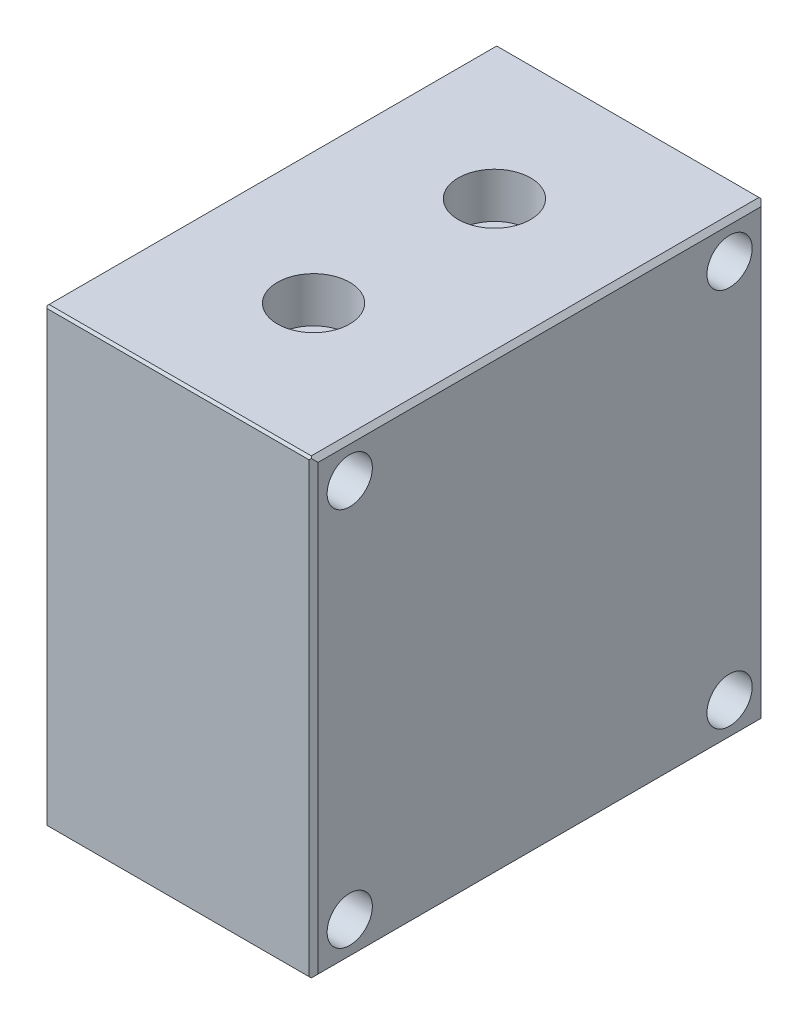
ISO-10303-21;
HEADER;
FILE_DESCRIPTION(('STEP AP214'),'2;1');
FILE_NAME('part.step','',(''),(''),'','','');
FILE_SCHEMA(('AUTOMOTIVE_DESIGN { 1 0 10303 214 1 1 1 1 }'));
ENDSEC;
DATA;
#1=APPLICATION_CONTEXT('core data for automotive mechanical design processes');
#2=APPLICATION_PROTOCOL_DEFINITION('international standard','automotive_design',2000,#1);
#3=PRODUCT_CONTEXT('',#1,'mechanical');
#4=PRODUCT('Part','Part','',(#3));
#5=PRODUCT_RELATED_PRODUCT_CATEGORY('part','',(#4));
#6=PRODUCT_DEFINITION_FORMATION('','',#4);
#7=PRODUCT_DEFINITION_CONTEXT('part definition',#1,'design');
#8=PRODUCT_DEFINITION('design','',#6,#7);
#9=PRODUCT_DEFINITION_SHAPE('','',#8);
#10=(LENGTH_UNIT() NAMED_UNIT(*) SI_UNIT(.MILLI.,.METRE.));
#11=(NAMED_UNIT(*) PLANE_ANGLE_UNIT() SI_UNIT($,.RADIAN.));
#12=(NAMED_UNIT(*) SI_UNIT($,.STERADIAN.) SOLID_ANGLE_UNIT());
#13=UNCERTAINTY_MEASURE_WITH_UNIT(LENGTH_MEASURE(1.E-05),#10,'distance_accuracy_value','');
#14=(GEOMETRIC_REPRESENTATION_CONTEXT(3) GLOBAL_UNCERTAINTY_ASSIGNED_CONTEXT((#13)) GLOBAL_UNIT_ASSIGNED_CONTEXT((#10,
#11,#12)) REPRESENTATION_CONTEXT('',''));
#15=CARTESIAN_POINT('',(0.,0.,0.));
#16=DIRECTION('',(0.,0.,1.));
#17=DIRECTION('',(1.,0.,0.));
#18=AXIS2_PLACEMENT_3D('',#15,#16,#17);
#19=CARTESIAN_POINT('',(0.,20.,0.));
#20=DIRECTION('',(0.,1.,0.));
#21=DIRECTION('',(0.,0.,1.));
#22=AXIS2_PLACEMENT_3D('',#19,#20,#21);
#23=PLANE('',#22);
#24=CARTESIAN_POINT('',(15.,20.,10.));
#25=DIRECTION('',(0.,1.,0.));
#26=DIRECTION('',(0.,0.,1.));
#27=AXIS2_PLACEMENT_3D('',#24,#25,#26);
#28=CIRCLE('',#27,4.);
#29=CARTESIAN_POINT('',(15.,20.,14.));
#30=VERTEX_POINT('',#29);
#31=EDGE_CURVE('E19',#30,#30,#28,.T.);
#32=ORIENTED_EDGE('',*,*,#31,.T.);
#33=EDGE_LOOP('',(#32));
#34=FACE_BOUND('',#33,.T.);
#35=ADVANCED_FACE('F16',(#34),#23,.T.);
#36=CARTESIAN_POINT('',(0.,20.,0.));
#37=DIRECTION('',(0.,1.,0.));
#38=DIRECTION('',(0.,0.,1.));
#39=AXIS2_PLACEMENT_3D('',#36,#37,#38);
#40=PLANE('',#39);
#41=CARTESIAN_POINT('',(15.,20.,-10.));
#42=DIRECTION('',(0.,1.,0.));
#43=DIRECTION('',(0.,0.,1.));
#44=AXIS2_PLACEMENT_3D('',#41,#42,#43);
#45=CIRCLE('',#44,4.);
#46=CARTESIAN_POINT('',(15.,20.,-6.));
#47=VERTEX_POINT('',#46);
#48=EDGE_CURVE('E160',#47,#47,#45,.T.);
#49=ORIENTED_EDGE('',*,*,#48,.T.);
#50=EDGE_LOOP('',(#49));
#51=FACE_BOUND('',#50,.T.);
#52=ADVANCED_FACE('F424',(#51),#40,.T.);
#53=CARTESIAN_POINT('',(15.,24.875,-24.875));
#54=DIRECTION('',(0.,0.707106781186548,-0.707106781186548));
#55=DIRECTION('',(0.,0.707106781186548,0.707106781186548));
#56=AXIS2_PLACEMENT_3D('',#53,#54,#55);
#57=PLANE('',#56);
#58=DIRECTION('',(-0.577350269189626,0.577350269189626,0.577350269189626));
#59=VECTOR('',#58,1.);
#60=CARTESIAN_POINT('',(29.625,24.875,-24.875));
#61=LINE('',#60,#59);
#62=CARTESIAN_POINT('',(29.625,24.875,-24.875));
#63=VERTEX_POINT('',#62);
#64=CARTESIAN_POINT('',(29.5,25.,-24.75));
#65=VERTEX_POINT('',#64);
#66=EDGE_CURVE('E211',#63,#65,#61,.T.);
#67=ORIENTED_EDGE('',*,*,#66,.F.);
#68=DIRECTION('',(0.577350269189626,0.577350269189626,0.577350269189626));
#69=VECTOR('',#68,1.);
#70=CARTESIAN_POINT('',(29.5,24.75,-25.));
#71=LINE('',#70,#69);
#72=CARTESIAN_POINT('',(29.5,24.75,-25.));
#73=VERTEX_POINT('',#72);
#74=EDGE_CURVE('E234',#73,#63,#71,.T.);
#75=ORIENTED_EDGE('',*,*,#74,.F.);
#76=DIRECTION('',(-1.,0.,0.));
#77=VECTOR('',#76,1.);
#78=CARTESIAN_POINT('',(0.,24.75,-25.));
#79=LINE('',#78,#77);
#80=CARTESIAN_POINT('',(0.5,24.75,-25.));
#81=VERTEX_POINT('',#80);
#82=EDGE_CURVE('E139',#81,#73,#79,.F.);
#83=ORIENTED_EDGE('',*,*,#82,.F.);
#84=DIRECTION('',(-0.577350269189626,0.577350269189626,0.577350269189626));
#85=VECTOR('',#84,1.);
#86=CARTESIAN_POINT('',(0.499999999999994,24.75,-25.));
#87=LINE('',#86,#85);
#88=CARTESIAN_POINT('',(0.375,24.875,-24.875));
#89=VERTEX_POINT('',#88);
#90=EDGE_CURVE('E131',#81,#89,#87,.T.);
#91=ORIENTED_EDGE('',*,*,#90,.T.);
#92=DIRECTION('',(0.577350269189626,0.577350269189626,0.577350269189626));
#93=VECTOR('',#92,1.);
#94=CARTESIAN_POINT('',(0.374999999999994,24.875,-24.875));
#95=LINE('',#94,#93);
#96=CARTESIAN_POINT('',(0.499999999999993,25.,-24.75));
#97=VERTEX_POINT('',#96);
#98=EDGE_CURVE('E136',#89,#97,#95,.T.);
#99=ORIENTED_EDGE('',*,*,#98,.T.);
#100=DIRECTION('',(1.,0.,0.));
#101=VECTOR('',#100,1.);
#102=CARTESIAN_POINT('',(0.,25.,-24.75));
#103=LINE('',#102,#101);
#104=EDGE_CURVE('E244',#65,#97,#103,.F.);
#105=ORIENTED_EDGE('',*,*,#104,.F.);
#106=EDGE_LOOP('',(#67,#75,#83,#91,#99,#105));
#107=FACE_BOUND('',#106,.T.);
#108=ADVANCED_FACE('F133',(#107),#57,.T.);
#109=CARTESIAN_POINT('',(15.,25.,10.));
#110=DIRECTION('',(0.,1.,0.));
#111=DIRECTION('',(0.,0.,1.));
#112=AXIS2_PLACEMENT_3D('',#109,#110,#111);
#113=CYLINDRICAL_SURFACE('',#112,4.);
#114=ORIENTED_EDGE('',*,*,#31,.F.);
#115=EDGE_LOOP('',(#114));
#116=FACE_BOUND('',#115,.T.);
#117=CARTESIAN_POINT('',(15.,25.,10.));
#118=DIRECTION('',(0.,1.,0.));
#119=DIRECTION('',(0.,0.,1.));
#120=AXIS2_PLACEMENT_3D('',#117,#118,#119);
#121=CIRCLE('',#120,4.);
#122=CARTESIAN_POINT('',(15.,25.,14.));
#123=VERTEX_POINT('',#122);
#124=EDGE_CURVE('E190',#123,#123,#121,.F.);
#125=ORIENTED_EDGE('',*,*,#124,.F.);
#126=EDGE_LOOP('',(#125));
#127=FACE_BOUND('',#126,.T.);
#128=ADVANCED_FACE('F418',(#116,#127),#113,.F.);
#129=CARTESIAN_POINT('',(15.,25.,-10.));
#130=DIRECTION('',(0.,1.,0.));
#131=DIRECTION('',(0.,0.,1.));
#132=AXIS2_PLACEMENT_3D('',#129,#130,#131);
#133=CYLINDRICAL_SURFACE('',#132,4.);
#134=ORIENTED_EDGE('',*,*,#48,.F.);
#135=EDGE_LOOP('',(#134));
#136=FACE_BOUND('',#135,.T.);
#137=CARTESIAN_POINT('',(15.,25.,-10.));
#138=DIRECTION('',(0.,1.,0.));
#139=DIRECTION('',(0.,0.,1.));
#140=AXIS2_PLACEMENT_3D('',#137,#138,#139);
#141=CIRCLE('',#140,4.);
#142=CARTESIAN_POINT('',(15.,25.,-6.));
#143=VERTEX_POINT('',#142);
#144=EDGE_CURVE('E186',#143,#143,#141,.F.);
#145=ORIENTED_EDGE('',*,*,#144,.F.);
#146=EDGE_LOOP('',(#145));
#147=FACE_BOUND('',#146,.T.);
#148=ADVANCED_FACE('F415',(#136,#147),#133,.F.);
#149=CARTESIAN_POINT('',(15.,24.875,24.875));
#150=DIRECTION('',(0.,0.707106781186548,0.707106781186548));
#151=DIRECTION('',(0.,-0.707106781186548,0.707106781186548));
#152=AXIS2_PLACEMENT_3D('',#149,#150,#151);
#153=PLANE('',#152);
#154=DIRECTION('',(1.,0.,0.));
#155=VECTOR('',#154,1.);
#156=CARTESIAN_POINT('',(0.,24.75,25.));
#157=LINE('',#156,#155);
#158=CARTESIAN_POINT('',(29.5,24.75,25.));
#159=VERTEX_POINT('',#158);
#160=CARTESIAN_POINT('',(0.499999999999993,24.75,25.));
#161=VERTEX_POINT('',#160);
#162=EDGE_CURVE('E189',#159,#161,#157,.F.);
#163=ORIENTED_EDGE('',*,*,#162,.F.);
#164=DIRECTION('',(-0.577350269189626,-0.577350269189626,0.577350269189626));
#165=VECTOR('',#164,1.);
#166=CARTESIAN_POINT('',(29.625,24.875,24.875));
#167=LINE('',#166,#165);
#168=CARTESIAN_POINT('',(29.625,24.875,24.875));
#169=VERTEX_POINT('',#168);
#170=EDGE_CURVE('E216',#169,#159,#167,.T.);
#171=ORIENTED_EDGE('',*,*,#170,.F.);
#172=DIRECTION('',(0.577350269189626,-0.577350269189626,0.577350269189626));
#173=VECTOR('',#172,1.);
#174=CARTESIAN_POINT('',(29.5,25.,24.75));
#175=LINE('',#174,#173);
#176=CARTESIAN_POINT('',(29.5,25.,24.75));
#177=VERTEX_POINT('',#176);
#178=EDGE_CURVE('E209',#177,#169,#175,.T.);
#179=ORIENTED_EDGE('',*,*,#178,.F.);
#180=DIRECTION('',(1.,0.,0.));
#181=VECTOR('',#180,1.);
#182=CARTESIAN_POINT('',(0.,25.,24.75));
#183=LINE('',#182,#181);
#184=CARTESIAN_POINT('',(0.499999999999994,25.,24.75));
#185=VERTEX_POINT('',#184);
#186=EDGE_CURVE('E246',#185,#177,#183,.T.);
#187=ORIENTED_EDGE('',*,*,#186,.F.);
#188=DIRECTION('',(-0.577350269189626,-0.577350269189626,0.577350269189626));
#189=VECTOR('',#188,1.);
#190=CARTESIAN_POINT('',(0.499999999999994,25.,24.75));
#191=LINE('',#190,#189);
#192=CARTESIAN_POINT('',(0.375,24.875,24.875));
#193=VERTEX_POINT('',#192);
#194=EDGE_CURVE('E126',#185,#193,#191,.T.);
#195=ORIENTED_EDGE('',*,*,#194,.T.);
#196=DIRECTION('',(0.577350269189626,-0.577350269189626,0.577350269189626));
#197=VECTOR('',#196,1.);
#198=CARTESIAN_POINT('',(0.374999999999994,24.875,24.875));
#199=LINE('',#198,#197);
#200=EDGE_CURVE('E196',#193,#161,#199,.T.);
#201=ORIENTED_EDGE('',*,*,#200,.T.);
#202=EDGE_LOOP('',(#163,#171,#179,#187,#195,#201));
#203=FACE_BOUND('',#202,.T.);
#204=ADVANCED_FACE('F300',(#203),#153,.T.);
#205=CARTESIAN_POINT('',(15.,-24.875,24.875));
#206=DIRECTION('',(0.,-0.707106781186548,0.707106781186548));
#207=DIRECTION('',(0.,-0.707106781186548,-0.707106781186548));
#208=AXIS2_PLACEMENT_3D('',#205,#206,#207);
#209=PLANE('',#208);
#210=DIRECTION('',(1.,0.,0.));
#211=VECTOR('',#210,1.);
#212=CARTESIAN_POINT('',(0.,-25.,24.75));
#213=LINE('',#212,#211);
#214=CARTESIAN_POINT('',(29.5,-25.,24.75));
#215=VERTEX_POINT('',#214);
#216=CARTESIAN_POINT('',(0.499999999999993,-25.,24.75));
#217=VERTEX_POINT('',#216);
#218=EDGE_CURVE('E256',#215,#217,#213,.F.);
#219=ORIENTED_EDGE('',*,*,#218,.F.);
#220=DIRECTION('',(-0.577350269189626,-0.577350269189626,-0.577350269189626));
#221=VECTOR('',#220,1.);
#222=CARTESIAN_POINT('',(29.625,-24.875,24.875));
#223=LINE('',#222,#221);
#224=CARTESIAN_POINT('',(29.625,-24.875,24.875));
#225=VERTEX_POINT('',#224);
#226=EDGE_CURVE('E223',#225,#215,#223,.T.);
#227=ORIENTED_EDGE('',*,*,#226,.F.);
#228=DIRECTION('',(0.577350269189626,-0.577350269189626,-0.577350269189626));
#229=VECTOR('',#228,1.);
#230=CARTESIAN_POINT('',(29.5,-24.75,25.));
#231=LINE('',#230,#229);
#232=CARTESIAN_POINT('',(29.5,-24.75,25.));
#233=VERTEX_POINT('',#232);
#234=EDGE_CURVE('E218',#233,#225,#231,.T.);
#235=ORIENTED_EDGE('',*,*,#234,.F.);
#236=DIRECTION('',(1.,0.,0.));
#237=VECTOR('',#236,1.);
#238=CARTESIAN_POINT('',(0.,-24.75,25.));
#239=LINE('',#238,#237);
#240=CARTESIAN_POINT('',(0.499999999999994,-24.75,25.));
#241=VERTEX_POINT('',#240);
#242=EDGE_CURVE('E251',#241,#233,#239,.T.);
#243=ORIENTED_EDGE('',*,*,#242,.F.);
#244=DIRECTION('',(-0.577350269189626,-0.577350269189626,-0.577350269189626));
#245=VECTOR('',#244,1.);
#246=CARTESIAN_POINT('',(0.499999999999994,-24.75,25.));
#247=LINE('',#246,#245);
#248=CARTESIAN_POINT('',(0.375,-24.875,24.875));
#249=VERTEX_POINT('',#248);
#250=EDGE_CURVE('E197',#241,#249,#247,.T.);
#251=ORIENTED_EDGE('',*,*,#250,.T.);
#252=DIRECTION('',(0.577350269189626,-0.577350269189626,-0.577350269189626));
#253=VECTOR('',#252,1.);
#254=CARTESIAN_POINT('',(0.374999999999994,-24.875,24.875));
#255=LINE('',#254,#253);
#256=EDGE_CURVE('E201',#249,#217,#255,.T.);
#257=ORIENTED_EDGE('',*,*,#256,.T.);
#258=EDGE_LOOP('',(#219,#227,#235,#243,#251,#257));
#259=FACE_BOUND('',#258,.T.);
#260=ADVANCED_FACE('F395',(#259),#209,.T.);
#261=CARTESIAN_POINT('',(15.,-24.875,-24.875));
#262=DIRECTION('',(0.,-0.707106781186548,-0.707106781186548));
#263=DIRECTION('',(0.,0.707106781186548,-0.707106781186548));
#264=AXIS2_PLACEMENT_3D('',#261,#262,#263);
#265=PLANE('',#264);
#266=DIRECTION('',(-1.,0.,0.));
#267=VECTOR('',#266,1.);
#268=CARTESIAN_POINT('',(0.,-24.75,-25.));
#269=LINE('',#268,#267);
#270=CARTESIAN_POINT('',(29.5,-24.75,-25.));
#271=VERTEX_POINT('',#270);
#272=CARTESIAN_POINT('',(0.499999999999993,-24.75,-25.));
#273=VERTEX_POINT('',#272);
#274=EDGE_CURVE('E237',#271,#273,#269,.T.);
#275=ORIENTED_EDGE('',*,*,#274,.F.);
#276=DIRECTION('',(-0.577350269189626,0.577350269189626,-0.577350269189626));
#277=VECTOR('',#276,1.);
#278=CARTESIAN_POINT('',(29.625,-24.875,-24.875));
#279=LINE('',#278,#277);
#280=CARTESIAN_POINT('',(29.625,-24.875,-24.875));
#281=VERTEX_POINT('',#280);
#282=EDGE_CURVE('E232',#281,#271,#279,.T.);
#283=ORIENTED_EDGE('',*,*,#282,.F.);
#284=DIRECTION('',(0.577350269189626,0.577350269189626,-0.577350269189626));
#285=VECTOR('',#284,1.);
#286=CARTESIAN_POINT('',(29.5,-25.,-24.75));
#287=LINE('',#286,#285);
#288=CARTESIAN_POINT('',(29.5,-25.,-24.75));
#289=VERTEX_POINT('',#288);
#290=EDGE_CURVE('E225',#289,#281,#287,.T.);
#291=ORIENTED_EDGE('',*,*,#290,.F.);
#292=DIRECTION('',(1.,0.,0.));
#293=VECTOR('',#292,1.);
#294=CARTESIAN_POINT('',(0.,-25.,-24.75));
#295=LINE('',#294,#293);
#296=CARTESIAN_POINT('',(0.5,-25.,-24.75));
#297=VERTEX_POINT('',#296);
#298=EDGE_CURVE('E259',#297,#289,#295,.T.);
#299=ORIENTED_EDGE('',*,*,#298,.F.);
#300=DIRECTION('',(-0.577350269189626,0.577350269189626,-0.577350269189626));
#301=VECTOR('',#300,1.);
#302=CARTESIAN_POINT('',(0.499999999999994,-25.,-24.75));
#303=LINE('',#302,#301);
#304=CARTESIAN_POINT('',(0.375,-24.875,-24.875));
#305=VERTEX_POINT('',#304);
#306=EDGE_CURVE('E205',#297,#305,#303,.T.);
#307=ORIENTED_EDGE('',*,*,#306,.T.);
#308=DIRECTION('',(0.577350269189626,0.577350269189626,-0.577350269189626));
#309=VECTOR('',#308,1.);
#310=CARTESIAN_POINT('',(0.374999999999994,-24.875,-24.875));
#311=LINE('',#310,#309);
#312=EDGE_CURVE('E207',#305,#273,#311,.T.);
#313=ORIENTED_EDGE('',*,*,#312,.T.);
#314=EDGE_LOOP('',(#275,#283,#291,#299,#307,#313));
#315=FACE_BOUND('',#314,.T.);
#316=ADVANCED_FACE('F325',(#315),#265,.T.);
#317=CARTESIAN_POINT('',(29.75,24.75,0.));
#318=DIRECTION('',(0.707106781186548,0.707106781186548,0.));
#319=DIRECTION('',(-0.707106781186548,0.707106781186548,0.));
#320=AXIS2_PLACEMENT_3D('',#317,#318,#319);
#321=PLANE('',#320);
#322=DIRECTION('',(0.577350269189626,-0.577350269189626,0.577350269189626));
#323=VECTOR('',#322,1.);
#324=CARTESIAN_POINT('',(29.625,24.875,-24.875));
#325=LINE('',#324,#323);
#326=CARTESIAN_POINT('',(30.,24.5,-24.5));
#327=VERTEX_POINT('',#326);
#328=EDGE_CURVE('E227',#63,#327,#325,.T.);
#329=ORIENTED_EDGE('',*,*,#328,.F.);
#330=ORIENTED_EDGE('',*,*,#66,.T.);
#331=DIRECTION('',(0.,0.,1.));
#332=VECTOR('',#331,1.);
#333=CARTESIAN_POINT('',(29.5,25.,-25.));
#334=LINE('',#333,#332);
#335=EDGE_CURVE('E192',#177,#65,#334,.F.);
#336=ORIENTED_EDGE('',*,*,#335,.F.);
#337=ORIENTED_EDGE('',*,*,#178,.T.);
#338=DIRECTION('',(-0.577350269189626,0.577350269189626,0.577350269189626));
#339=VECTOR('',#338,1.);
#340=CARTESIAN_POINT('',(30.,24.5,24.5));
#341=LINE('',#340,#339);
#342=CARTESIAN_POINT('',(30.,24.5,24.5));
#343=VERTEX_POINT('',#342);
#344=EDGE_CURVE('E213',#343,#169,#341,.T.);
#345=ORIENTED_EDGE('',*,*,#344,.F.);
#346=DIRECTION('',(0.,0.,-1.));
#347=VECTOR('',#346,1.);
#348=CARTESIAN_POINT('',(30.,24.5,0.));
#349=LINE('',#348,#347);
#350=EDGE_CURVE('E264',#327,#343,#349,.F.);
#351=ORIENTED_EDGE('',*,*,#350,.F.);
#352=EDGE_LOOP('',(#329,#330,#336,#337,#345,#351));
#353=FACE_BOUND('',#352,.T.);
#354=ADVANCED_FACE('F312',(#353),#321,.T.);
#355=CARTESIAN_POINT('',(29.75,0.,24.75));
#356=DIRECTION('',(0.707106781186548,0.,0.707106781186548));
#357=DIRECTION('',(0.707106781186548,0.,-0.707106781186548));
#358=AXIS2_PLACEMENT_3D('',#355,#356,#357);
#359=PLANE('',#358);
#360=DIRECTION('',(0.,1.,0.));
#361=VECTOR('',#360,1.);
#362=CARTESIAN_POINT('',(29.5,25.,25.));
#363=LINE('',#362,#361);
#364=EDGE_CURVE('E253',#233,#159,#363,.T.);
#365=ORIENTED_EDGE('',*,*,#364,.F.);
#366=ORIENTED_EDGE('',*,*,#234,.T.);
#367=DIRECTION('',(-0.577350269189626,-0.577350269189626,0.577350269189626));
#368=VECTOR('',#367,1.);
#369=CARTESIAN_POINT('',(30.,-24.5,24.5));
#370=LINE('',#369,#368);
#371=CARTESIAN_POINT('',(30.,-24.5,24.5));
#372=VERTEX_POINT('',#371);
#373=EDGE_CURVE('E220',#372,#225,#370,.T.);
#374=ORIENTED_EDGE('',*,*,#373,.F.);
#375=DIRECTION('',(0.,1.,0.));
#376=VECTOR('',#375,1.);
#377=CARTESIAN_POINT('',(30.,0.,24.5));
#378=LINE('',#377,#376);
#379=EDGE_CURVE('E266',#343,#372,#378,.F.);
#380=ORIENTED_EDGE('',*,*,#379,.F.);
#381=ORIENTED_EDGE('',*,*,#344,.T.);
#382=ORIENTED_EDGE('',*,*,#170,.T.);
#383=EDGE_LOOP('',(#365,#366,#374,#380,#381,#382));
#384=FACE_BOUND('',#383,.T.);
#385=ADVANCED_FACE('F397',(#384),#359,.T.);
#386=CARTESIAN_POINT('',(29.75,-24.75,0.));
#387=DIRECTION('',(0.707106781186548,-0.707106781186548,0.));
#388=DIRECTION('',(0.707106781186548,0.707106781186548,0.));
#389=AXIS2_PLACEMENT_3D('',#386,#387,#388);
#390=PLANE('',#389);
#391=DIRECTION('',(0.,0.,-1.));
#392=VECTOR('',#391,1.);
#393=CARTESIAN_POINT('',(29.5,-25.,25.));
#394=LINE('',#393,#392);
#395=EDGE_CURVE('E261',#289,#215,#394,.F.);
#396=ORIENTED_EDGE('',*,*,#395,.F.);
#397=ORIENTED_EDGE('',*,*,#290,.T.);
#398=DIRECTION('',(-0.577350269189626,-0.577350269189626,-0.577350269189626));
#399=VECTOR('',#398,1.);
#400=CARTESIAN_POINT('',(30.,-24.5,-24.5));
#401=LINE('',#400,#399);
#402=CARTESIAN_POINT('',(30.,-24.5,-24.5));
#403=VERTEX_POINT('',#402);
#404=EDGE_CURVE('E229',#403,#281,#401,.T.);
#405=ORIENTED_EDGE('',*,*,#404,.F.);
#406=DIRECTION('',(0.,0.,-1.));
#407=VECTOR('',#406,1.);
#408=CARTESIAN_POINT('',(30.,-24.5,0.));
#409=LINE('',#408,#407);
#410=EDGE_CURVE('E268',#372,#403,#409,.T.);
#411=ORIENTED_EDGE('',*,*,#410,.F.);
#412=ORIENTED_EDGE('',*,*,#373,.T.);
#413=ORIENTED_EDGE('',*,*,#226,.T.);
#414=EDGE_LOOP('',(#396,#397,#405,#411,#412,#413));
#415=FACE_BOUND('',#414,.T.);
#416=ADVANCED_FACE('F341',(#415),#390,.T.);
#417=CARTESIAN_POINT('',(29.75,0.,-24.75));
#418=DIRECTION('',(0.707106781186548,0.,-0.707106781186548));
#419=DIRECTION('',(-0.707106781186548,0.,-0.707106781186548));
#420=AXIS2_PLACEMENT_3D('',#417,#418,#419);
#421=PLANE('',#420);
#422=DIRECTION('',(0.,1.,0.));
#423=VECTOR('',#422,1.);
#424=CARTESIAN_POINT('',(29.5,-25.,-25.));
#425=LINE('',#424,#423);
#426=EDGE_CURVE('E241',#73,#271,#425,.F.);
#427=ORIENTED_EDGE('',*,*,#426,.F.);
#428=ORIENTED_EDGE('',*,*,#74,.T.);
#429=ORIENTED_EDGE('',*,*,#328,.T.);
#430=DIRECTION('',(0.,1.,0.));
#431=VECTOR('',#430,1.);
#432=CARTESIAN_POINT('',(30.,0.,-24.5));
#433=LINE('',#432,#431);
#434=EDGE_CURVE('E270',#403,#327,#433,.T.);
#435=ORIENTED_EDGE('',*,*,#434,.F.);
#436=ORIENTED_EDGE('',*,*,#404,.T.);
#437=ORIENTED_EDGE('',*,*,#282,.T.);
#438=EDGE_LOOP('',(#427,#428,#429,#435,#436,#437));
#439=FACE_BOUND('',#438,.T.);
#440=ADVANCED_FACE('F309',(#439),#421,.T.);
#441=CARTESIAN_POINT('',(0.,-25.,-25.));
#442=DIRECTION('',(0.,0.,-1.));
#443=DIRECTION('',(-1.,0.,0.));
#444=AXIS2_PLACEMENT_3D('',#441,#442,#443);
#445=PLANE('',#444);
#446=ORIENTED_EDGE('',*,*,#82,.T.);
#447=ORIENTED_EDGE('',*,*,#426,.T.);
#448=ORIENTED_EDGE('',*,*,#274,.T.);
#449=DIRECTION('',(0.,1.,0.));
#450=VECTOR('',#449,1.);
#451=CARTESIAN_POINT('',(0.5,0.,-25.));
#452=LINE('',#451,#450);
#453=EDGE_CURVE('E153',#81,#273,#452,.F.);
#454=ORIENTED_EDGE('',*,*,#453,.F.);
#455=EDGE_LOOP('',(#446,#447,#448,#454));
#456=FACE_BOUND('',#455,.T.);
#457=ADVANCED_FACE('F329',(#456),#445,.T.);
#458=CARTESIAN_POINT('',(0.,25.,-25.));
#459=DIRECTION('',(0.,1.,0.));
#460=DIRECTION('',(0.,0.,1.));
#461=AXIS2_PLACEMENT_3D('',#458,#459,#460);
#462=PLANE('',#461);
#463=ORIENTED_EDGE('',*,*,#144,.T.);
#464=EDGE_LOOP('',(#463));
#465=FACE_BOUND('',#464,.T.);
#466=ORIENTED_EDGE('',*,*,#124,.T.);
#467=EDGE_LOOP('',(#466));
#468=FACE_BOUND('',#467,.T.);
#469=ORIENTED_EDGE('',*,*,#186,.T.);
#470=ORIENTED_EDGE('',*,*,#335,.T.);
#471=ORIENTED_EDGE('',*,*,#104,.T.);
#472=DIRECTION('',(0.,0.,1.));
#473=VECTOR('',#472,1.);
#474=CARTESIAN_POINT('',(0.5,25.,0.));
#475=LINE('',#474,#473);
#476=EDGE_CURVE('E152',#185,#97,#475,.F.);
#477=ORIENTED_EDGE('',*,*,#476,.F.);
#478=EDGE_LOOP('',(#469,#470,#471,#477));
#479=FACE_BOUND('',#478,.T.);
#480=ADVANCED_FACE('F304',(#465,#468,#479),#462,.T.);
#481=CARTESIAN_POINT('',(0.,25.,25.));
#482=DIRECTION('',(0.,0.,1.));
#483=DIRECTION('',(1.,0.,0.));
#484=AXIS2_PLACEMENT_3D('',#481,#482,#483);
#485=PLANE('',#484);
#486=ORIENTED_EDGE('',*,*,#242,.T.);
#487=ORIENTED_EDGE('',*,*,#364,.T.);
#488=ORIENTED_EDGE('',*,*,#162,.T.);
#489=DIRECTION('',(0.,1.,0.));
#490=VECTOR('',#489,1.);
#491=CARTESIAN_POINT('',(0.5,0.,25.));
#492=LINE('',#491,#490);
#493=EDGE_CURVE('E277',#241,#161,#492,.T.);
#494=ORIENTED_EDGE('',*,*,#493,.F.);
#495=EDGE_LOOP('',(#486,#487,#488,#494));
#496=FACE_BOUND('',#495,.T.);
#497=ADVANCED_FACE('F338',(#496),#485,.T.);
#498=CARTESIAN_POINT('',(0.,-25.,25.));
#499=DIRECTION('',(0.,-1.,0.));
#500=DIRECTION('',(0.,0.,-1.));
#501=AXIS2_PLACEMENT_3D('',#498,#499,#500);
#502=PLANE('',#501);
#503=ORIENTED_EDGE('',*,*,#298,.T.);
#504=ORIENTED_EDGE('',*,*,#395,.T.);
#505=ORIENTED_EDGE('',*,*,#218,.T.);
#506=DIRECTION('',(0.,0.,1.));
#507=VECTOR('',#506,1.);
#508=CARTESIAN_POINT('',(0.5,-25.,0.));
#509=LINE('',#508,#507);
#510=EDGE_CURVE('E280',#297,#217,#509,.T.);
#511=ORIENTED_EDGE('',*,*,#510,.F.);
#512=EDGE_LOOP('',(#503,#504,#505,#511));
#513=FACE_BOUND('',#512,.T.);
#514=ADVANCED_FACE('F378',(#513),#502,.T.);
#515=CARTESIAN_POINT('',(30.,0.,0.));
#516=DIRECTION('',(1.,0.,0.));
#517=DIRECTION('',(0.,0.,-1.));
#518=AXIS2_PLACEMENT_3D('',#515,#516,#517);
#519=PLANE('',#518);
#520=CARTESIAN_POINT('',(30.,-21.,-21.));
#521=DIRECTION('',(-1.,0.,0.));
#522=DIRECTION('',(0.,0.,1.));
#523=AXIS2_PLACEMENT_3D('',#520,#521,#522);
#524=CIRCLE('',#523,2.5);
#525=CARTESIAN_POINT('',(30.,-21.,-18.5));
#526=VERTEX_POINT('',#525);
#527=EDGE_CURVE('E173',#526,#526,#524,.T.);
#528=ORIENTED_EDGE('',*,*,#527,.T.);
#529=EDGE_LOOP('',(#528));
#530=FACE_BOUND('',#529,.T.);
#531=CARTESIAN_POINT('',(30.,21.,21.));
#532=DIRECTION('',(-1.,0.,0.));
#533=DIRECTION('',(0.,0.,1.));
#534=AXIS2_PLACEMENT_3D('',#531,#532,#533);
#535=CIRCLE('',#534,2.5);
#536=CARTESIAN_POINT('',(30.,21.,23.5));
#537=VERTEX_POINT('',#536);
#538=EDGE_CURVE('E176',#537,#537,#535,.T.);
#539=ORIENTED_EDGE('',*,*,#538,.T.);
#540=EDGE_LOOP('',(#539));
#541=FACE_BOUND('',#540,.T.);
#542=CARTESIAN_POINT('',(30.,21.,-21.));
#543=DIRECTION('',(-1.,0.,0.));
#544=DIRECTION('',(0.,0.,1.));
#545=AXIS2_PLACEMENT_3D('',#542,#543,#544);
#546=CIRCLE('',#545,2.5);
#547=CARTESIAN_POINT('',(30.,21.,-18.5));
#548=VERTEX_POINT('',#547);
#549=EDGE_CURVE('E179',#548,#548,#546,.T.);
#550=ORIENTED_EDGE('',*,*,#549,.T.);
#551=EDGE_LOOP('',(#550));
#552=FACE_BOUND('',#551,.T.);
#553=CARTESIAN_POINT('',(30.,-21.,21.));
#554=DIRECTION('',(-1.,0.,0.));
#555=DIRECTION('',(0.,0.,1.));
#556=AXIS2_PLACEMENT_3D('',#553,#554,#555);
#557=CIRCLE('',#556,2.5);
#558=CARTESIAN_POINT('',(30.,-21.,23.5));
#559=VERTEX_POINT('',#558);
#560=EDGE_CURVE('E182',#559,#559,#557,.T.);
#561=ORIENTED_EDGE('',*,*,#560,.T.);
#562=EDGE_LOOP('',(#561));
#563=FACE_BOUND('',#562,.T.);
#564=ORIENTED_EDGE('',*,*,#410,.T.);
#565=ORIENTED_EDGE('',*,*,#434,.T.);
#566=ORIENTED_EDGE('',*,*,#350,.T.);
#567=ORIENTED_EDGE('',*,*,#379,.T.);
#568=EDGE_LOOP('',(#564,#565,#566,#567));
#569=FACE_BOUND('',#568,.T.);
#570=ADVANCED_FACE('F316',(#530,#541,#552,#563,#569),#519,.T.);
#571=CARTESIAN_POINT('',(0.25,0.,-24.75));
#572=DIRECTION('',(-0.707106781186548,0.,-0.707106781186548));
#573=DIRECTION('',(-0.707106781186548,0.,0.707106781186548));
#574=AXIS2_PLACEMENT_3D('',#571,#572,#573);
#575=PLANE('',#574);
#576=DIRECTION('',(-0.577350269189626,-0.577350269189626,0.577350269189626));
#577=VECTOR('',#576,1.);
#578=CARTESIAN_POINT('',(0.375,24.875,-24.875));
#579=LINE('',#578,#577);
#580=CARTESIAN_POINT('',(0.,24.5,-24.5));
#581=VERTEX_POINT('',#580);
#582=EDGE_CURVE('E145',#89,#581,#579,.T.);
#583=ORIENTED_EDGE('',*,*,#582,.F.);
#584=ORIENTED_EDGE('',*,*,#90,.F.);
#585=ORIENTED_EDGE('',*,*,#453,.T.);
#586=ORIENTED_EDGE('',*,*,#312,.F.);
#587=DIRECTION('',(0.577350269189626,-0.577350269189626,-0.577350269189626));
#588=VECTOR('',#587,1.);
#589=CARTESIAN_POINT('',(0.,-24.5,-24.5));
#590=LINE('',#589,#588);
#591=CARTESIAN_POINT('',(0.,-24.5,-24.5));
#592=VERTEX_POINT('',#591);
#593=EDGE_CURVE('E185',#592,#305,#590,.T.);
#594=ORIENTED_EDGE('',*,*,#593,.F.);
#595=DIRECTION('',(0.,1.,0.));
#596=VECTOR('',#595,1.);
#597=CARTESIAN_POINT('',(0.,0.,-24.5));
#598=LINE('',#597,#596);
#599=EDGE_CURVE('E148',#592,#581,#598,.T.);
#600=ORIENTED_EDGE('',*,*,#599,.T.);
#601=EDGE_LOOP('',(#583,#584,#585,#586,#594,#600));
#602=FACE_BOUND('',#601,.T.);
#603=ADVANCED_FACE('F146',(#602),#575,.T.);
#604=CARTESIAN_POINT('',(0.25,24.75,0.));
#605=DIRECTION('',(-0.707106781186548,0.707106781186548,0.));
#606=DIRECTION('',(-0.707106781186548,-0.707106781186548,0.));
#607=AXIS2_PLACEMENT_3D('',#604,#605,#606);
#608=PLANE('',#607);
#609=ORIENTED_EDGE('',*,*,#476,.T.);
#610=ORIENTED_EDGE('',*,*,#98,.F.);
#611=ORIENTED_EDGE('',*,*,#582,.T.);
#612=DIRECTION('',(0.,0.,-1.));
#613=VECTOR('',#612,1.);
#614=CARTESIAN_POINT('',(0.,24.5,0.));
#615=LINE('',#614,#613);
#616=CARTESIAN_POINT('',(0.,24.5,24.5));
#617=VERTEX_POINT('',#616);
#618=EDGE_CURVE('E287',#581,#617,#615,.F.);
#619=ORIENTED_EDGE('',*,*,#618,.T.);
#620=DIRECTION('',(-0.577350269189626,-0.577350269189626,-0.577350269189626));
#621=VECTOR('',#620,1.);
#622=CARTESIAN_POINT('',(0.375,24.875,24.875));
#623=LINE('',#622,#621);
#624=EDGE_CURVE('E275',#193,#617,#623,.T.);
#625=ORIENTED_EDGE('',*,*,#624,.F.);
#626=ORIENTED_EDGE('',*,*,#194,.F.);
#627=EDGE_LOOP('',(#609,#610,#611,#619,#625,#626));
#628=FACE_BOUND('',#627,.T.);
#629=ADVANCED_FACE('F156',(#628),#608,.T.);
#630=CARTESIAN_POINT('',(0.25,0.,24.75));
#631=DIRECTION('',(-0.707106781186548,0.,0.707106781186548));
#632=DIRECTION('',(0.707106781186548,0.,0.707106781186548));
#633=AXIS2_PLACEMENT_3D('',#630,#631,#632);
#634=PLANE('',#633);
#635=ORIENTED_EDGE('',*,*,#493,.T.);
#636=ORIENTED_EDGE('',*,*,#200,.F.);
#637=ORIENTED_EDGE('',*,*,#624,.T.);
#638=DIRECTION('',(0.,1.,0.));
#639=VECTOR('',#638,1.);
#640=CARTESIAN_POINT('',(0.,0.,24.5));
#641=LINE('',#640,#639);
#642=CARTESIAN_POINT('',(0.,-24.5,24.5));
#643=VERTEX_POINT('',#642);
#644=EDGE_CURVE('E289',#617,#643,#641,.F.);
#645=ORIENTED_EDGE('',*,*,#644,.T.);
#646=DIRECTION('',(-0.577350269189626,0.577350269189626,-0.577350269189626));
#647=VECTOR('',#646,1.);
#648=CARTESIAN_POINT('',(0.375,-24.875,24.875));
#649=LINE('',#648,#647);
#650=EDGE_CURVE('E34',#249,#643,#649,.T.);
#651=ORIENTED_EDGE('',*,*,#650,.F.);
#652=ORIENTED_EDGE('',*,*,#250,.F.);
#653=EDGE_LOOP('',(#635,#636,#637,#645,#651,#652));
#654=FACE_BOUND('',#653,.T.);
#655=ADVANCED_FACE('F298',(#654),#634,.T.);
#656=CARTESIAN_POINT('',(0.25,-24.75,0.));
#657=DIRECTION('',(-0.707106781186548,-0.707106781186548,0.));
#658=DIRECTION('',(0.707106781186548,-0.707106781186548,0.));
#659=AXIS2_PLACEMENT_3D('',#656,#657,#658);
#660=PLANE('',#659);
#661=ORIENTED_EDGE('',*,*,#593,.T.);
#662=ORIENTED_EDGE('',*,*,#306,.F.);
#663=ORIENTED_EDGE('',*,*,#510,.T.);
#664=ORIENTED_EDGE('',*,*,#256,.F.);
#665=ORIENTED_EDGE('',*,*,#650,.T.);
#666=DIRECTION('',(0.,0.,-1.));
#667=VECTOR('',#666,1.);
#668=CARTESIAN_POINT('',(0.,-24.5,0.));
#669=LINE('',#668,#667);
#670=EDGE_CURVE('E172',#643,#592,#669,.T.);
#671=ORIENTED_EDGE('',*,*,#670,.T.);
#672=EDGE_LOOP('',(#661,#662,#663,#664,#665,#671));
#673=FACE_BOUND('',#672,.T.);
#674=ADVANCED_FACE('F292',(#673),#660,.T.);
#675=CARTESIAN_POINT('',(30.,-21.,21.));
#676=DIRECTION('',(-1.,0.,0.));
#677=DIRECTION('',(0.,0.,1.));
#678=AXIS2_PLACEMENT_3D('',#675,#676,#677);
#679=CYLINDRICAL_SURFACE('',#678,2.5);
#680=ORIENTED_EDGE('',*,*,#560,.F.);
#681=EDGE_LOOP('',(#680));
#682=FACE_BOUND('',#681,.T.);
#683=CARTESIAN_POINT('',(0.,-21.,21.));
#684=DIRECTION('',(-1.,0.,0.));
#685=DIRECTION('',(0.,0.,1.));
#686=AXIS2_PLACEMENT_3D('',#683,#684,#685);
#687=CIRCLE('',#686,2.5);
#688=CARTESIAN_POINT('',(0.,-21.,23.5));
#689=VERTEX_POINT('',#688);
#690=EDGE_CURVE('E169',#689,#689,#687,.T.);
#691=ORIENTED_EDGE('',*,*,#690,.T.);
#692=EDGE_LOOP('',(#691));
#693=FACE_BOUND('',#692,.T.);
#694=ADVANCED_FACE('F363',(#682,#693),#679,.F.);
#695=CARTESIAN_POINT('',(30.,21.,-21.));
#696=DIRECTION('',(-1.,0.,0.));
#697=DIRECTION('',(0.,0.,1.));
#698=AXIS2_PLACEMENT_3D('',#695,#696,#697);
#699=CYLINDRICAL_SURFACE('',#698,2.5);
#700=ORIENTED_EDGE('',*,*,#549,.F.);
#701=EDGE_LOOP('',(#700));
#702=FACE_BOUND('',#701,.T.);
#703=CARTESIAN_POINT('',(0.,21.,-21.));
#704=DIRECTION('',(-1.,0.,0.));
#705=DIRECTION('',(0.,0.,1.));
#706=AXIS2_PLACEMENT_3D('',#703,#704,#705);
#707=CIRCLE('',#706,2.5);
#708=CARTESIAN_POINT('',(0.,21.,-18.5));
#709=VERTEX_POINT('',#708);
#710=EDGE_CURVE('E166',#709,#709,#707,.T.);
#711=ORIENTED_EDGE('',*,*,#710,.T.);
#712=EDGE_LOOP('',(#711));
#713=FACE_BOUND('',#712,.T.);
#714=ADVANCED_FACE('F359',(#702,#713),#699,.F.);
#715=CARTESIAN_POINT('',(30.,21.,21.));
#716=DIRECTION('',(-1.,0.,0.));
#717=DIRECTION('',(0.,0.,1.));
#718=AXIS2_PLACEMENT_3D('',#715,#716,#717);
#719=CYLINDRICAL_SURFACE('',#718,2.5);
#720=ORIENTED_EDGE('',*,*,#538,.F.);
#721=EDGE_LOOP('',(#720));
#722=FACE_BOUND('',#721,.T.);
#723=CARTESIAN_POINT('',(0.,21.,21.));
#724=DIRECTION('',(-1.,0.,0.));
#725=DIRECTION('',(0.,0.,1.));
#726=AXIS2_PLACEMENT_3D('',#723,#724,#725);
#727=CIRCLE('',#726,2.5);
#728=CARTESIAN_POINT('',(0.,21.,23.5));
#729=VERTEX_POINT('',#728);
#730=EDGE_CURVE('E25',#729,#729,#727,.T.);
#731=ORIENTED_EDGE('',*,*,#730,.T.);
#732=EDGE_LOOP('',(#731));
#733=FACE_BOUND('',#732,.T.);
#734=ADVANCED_FACE('F351',(#722,#733),#719,.F.);
#735=CARTESIAN_POINT('',(30.,-21.,-21.));
#736=DIRECTION('',(-1.,0.,0.));
#737=DIRECTION('',(0.,0.,1.));
#738=AXIS2_PLACEMENT_3D('',#735,#736,#737);
#739=CYLINDRICAL_SURFACE('',#738,2.5);
#740=ORIENTED_EDGE('',*,*,#527,.F.);
#741=EDGE_LOOP('',(#740));
#742=FACE_BOUND('',#741,.T.);
#743=CARTESIAN_POINT('',(0.,-21.,-21.));
#744=DIRECTION('',(-1.,0.,0.));
#745=DIRECTION('',(0.,0.,1.));
#746=AXIS2_PLACEMENT_3D('',#743,#744,#745);
#747=CIRCLE('',#746,2.5);
#748=CARTESIAN_POINT('',(0.,-21.,-18.5));
#749=VERTEX_POINT('',#748);
#750=EDGE_CURVE('E11',#749,#749,#747,.T.);
#751=ORIENTED_EDGE('',*,*,#750,.T.);
#752=EDGE_LOOP('',(#751));
#753=FACE_BOUND('',#752,.T.);
#754=ADVANCED_FACE('F344',(#742,#753),#739,.F.);
#755=CARTESIAN_POINT('',(0.,0.,0.));
#756=DIRECTION('',(1.,0.,0.));
#757=DIRECTION('',(0.,0.,-1.));
#758=AXIS2_PLACEMENT_3D('',#755,#756,#757);
#759=PLANE('',#758);
#760=ORIENTED_EDGE('',*,*,#750,.F.);
#761=EDGE_LOOP('',(#760));
#762=FACE_BOUND('',#761,.T.);
#763=ORIENTED_EDGE('',*,*,#730,.F.);
#764=EDGE_LOOP('',(#763));
#765=FACE_BOUND('',#764,.T.);
#766=ORIENTED_EDGE('',*,*,#710,.F.);
#767=EDGE_LOOP('',(#766));
#768=FACE_BOUND('',#767,.T.);
#769=ORIENTED_EDGE('',*,*,#690,.F.);
#770=EDGE_LOOP('',(#769));
#771=FACE_BOUND('',#770,.T.);
#772=ORIENTED_EDGE('',*,*,#644,.F.);
#773=ORIENTED_EDGE('',*,*,#618,.F.);
#774=ORIENTED_EDGE('',*,*,#599,.F.);
#775=ORIENTED_EDGE('',*,*,#670,.F.);
#776=EDGE_LOOP('',(#772,#773,#774,#775));
#777=FACE_BOUND('',#776,.T.);
#778=ADVANCED_FACE('F296',(#762,#765,#768,#771,#777),#759,.F.);
#779=CLOSED_SHELL('',(#35,#52,#108,#128,#148,#204,#260,#316,#354,#385,#416,#440,#457,#480,#497,
#514,#570,#603,#629,#655,#674,#694,#714,#734,#754,#778));
#780=MANIFOLD_SOLID_BREP('B1',#779);
#781=ADVANCED_BREP_SHAPE_REPRESENTATION('',(#18,#780),#14);
#782=SHAPE_DEFINITION_REPRESENTATION(#9,#781);
ENDSEC;
END-ISO-10303-21;
